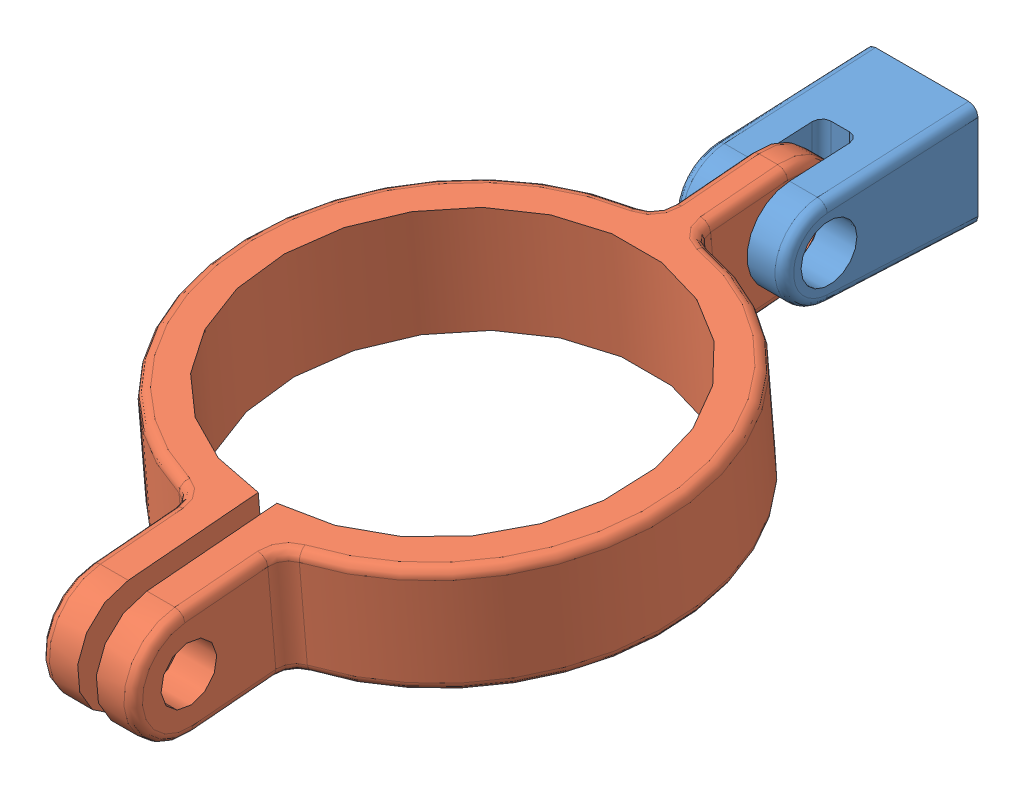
SolidWorks assembly Swivel-Brace.SLDASM, configuration Default (file format 4700). Lengths in mm.
Overall size (76.2 29.81 143.23).
2 component instances, 2 part files, 2 mates.
Components (placement in the parent):
- Swivel-1: Swivel.SLDPRT [Default] at origin size (19.05 17.78 33.02)
- Brace-1: Brace.SLDPRT [Default] at (0 -14.0944 78.3658) x (1 0 0) z (0 -0.0853 0.996355) size (76.2 19.05 126.97)
Mates (geometry in assembly coordinates):
- Concentric1: concentric aligned: cylinder of Swivel-1 through (-9.525 0 25.4) axis (1 0 0) radius 4.7625; cylinder of Brace-1 through (-38.1 0 25.4) axis (1 0 0) radius 4.7625
- Coincident1: coincident anti-aligned: plane of Swivel-1 through (-3.175 -8.89 13.97) normal (1 0 0); plane of Brace-1 through (-3.175 0 25.4) normal (-1 0 0)
